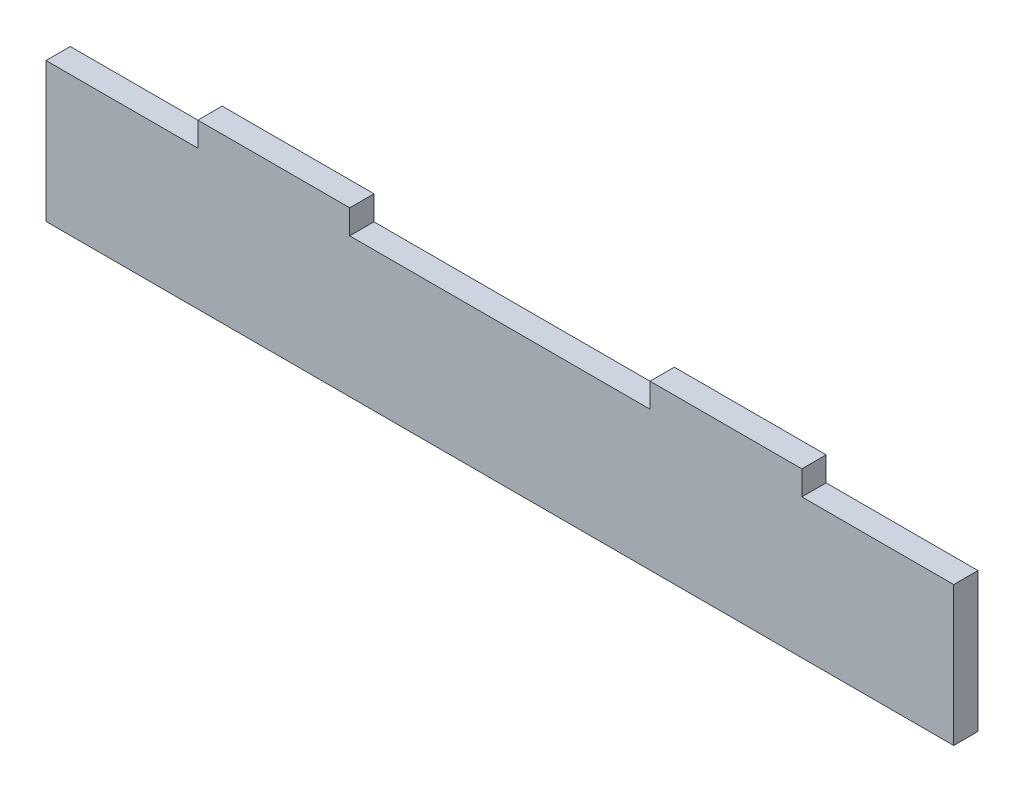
from build123d import *

# Parameters (mm, degrees)
SKETCH1_W           = 597.8
SKETCH1_H           = 91.8
SKETCH1_W_2         = 100
SKETCH1_H_2         = 16
BOSS_EXTRUDE1_DEPTH = 16


with BuildPart() as part:
    # Sketch1 → Boss-Extrude1 (new body)
    with BuildSketch(Plane.XY):
        with Locations((298.9, 45.9)):
            Rectangle(SKETCH1_W, SKETCH1_H)
        with Locations((150, 99.8)):
            Rectangle(SKETCH1_W_2, SKETCH1_H_2)
        with Locations((447.8, 99.8)):
            Rectangle(SKETCH1_W_2, SKETCH1_H_2)
    extrude(amount=BOSS_EXTRUDE1_DEPTH)


solid = part.part
